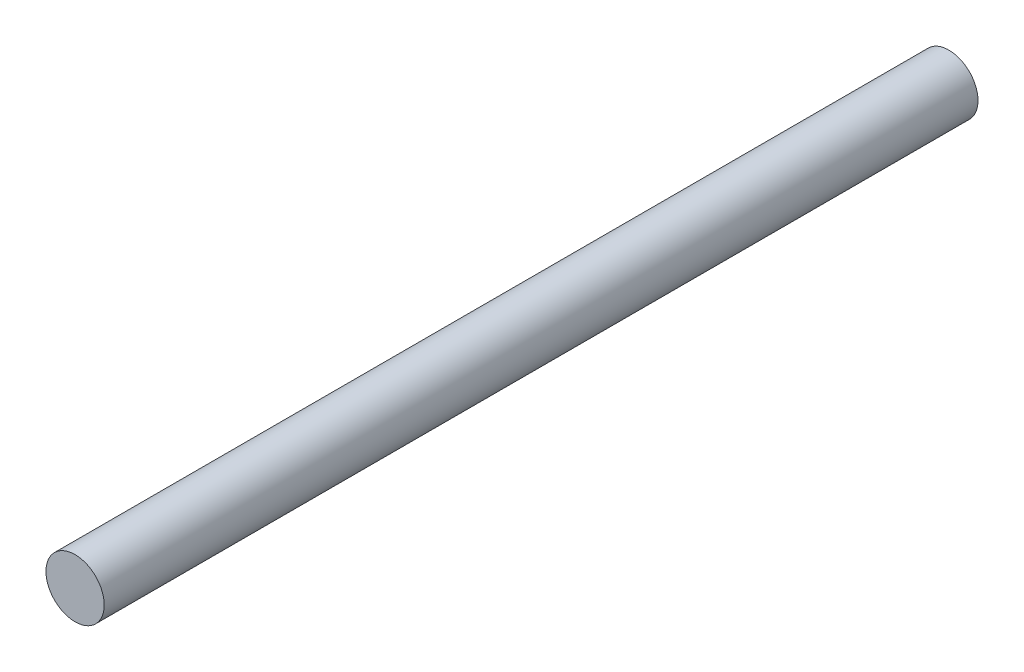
from build123d import *

# Parameters (mm, degrees)
CROQUIS1_R              = 0.5
SALIENTE_EXTRUIR1_DEPTH = 15


with BuildPart() as part:
    # Croquis1 → Saliente-Extruir1 (new body)
    with BuildSketch(Plane.XY):
        Circle(CROQUIS1_R)
    extrude(amount=SALIENTE_EXTRUIR1_DEPTH)


solid = part.part
